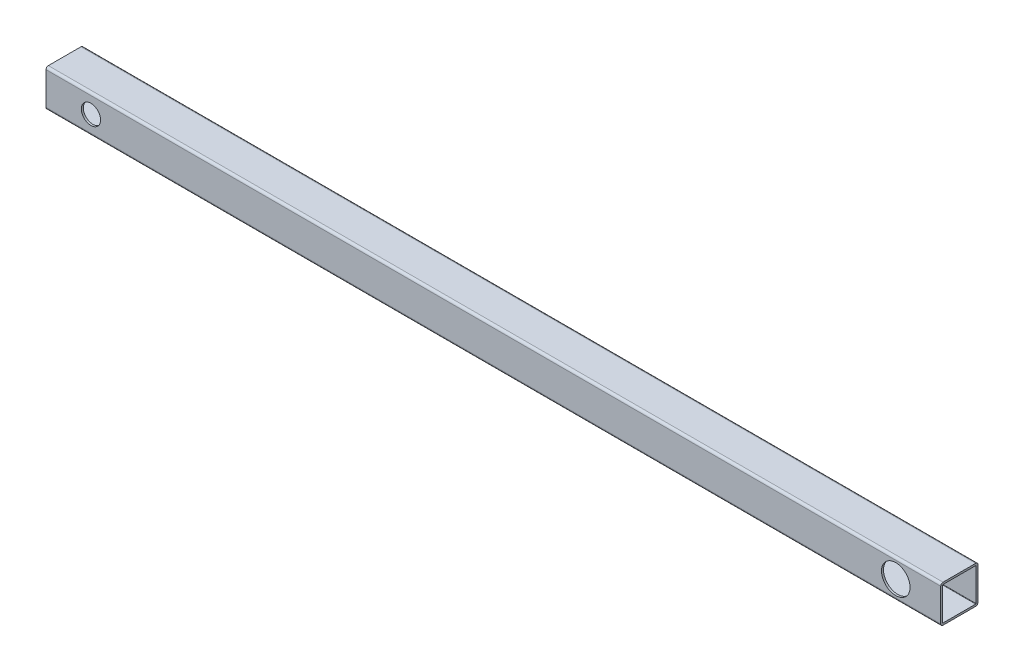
from build123d import *

# Parameters (mm, degrees)
EXTRUDE1_DEPTH          = 609.6
CUT_EXTRUDE1_DEPTH      = 611.407241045
CUT_EXTRUDE1_DEPTH_BACK = 611.407241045
SKETCH2_R               = 9.7234375
SKETCH2_R_2             = 6.5484375


with BuildPart() as part:
    # Sketch1 → Extrude1 (new body)
    with BuildSketch(Plane(origin=(0, 0, 0), x_dir=(0, 0, -1), z_dir=(1, 0, 0))):
        with BuildLine():
            Line((-5.373037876, 5.244240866), (16.851962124, 5.244240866))
            ThreePointArc((16.851962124, 5.244240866), (17.974494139, 4.779272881), (18.439462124, 3.656740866))
            Line((18.439462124, 3.656740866), (18.439462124, -18.568259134))
            ThreePointArc((18.439462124, -18.568259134), (17.974494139, -19.690791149), (16.851962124, -20.155759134))
            Line((16.851962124, -20.155759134), (-5.373037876, -20.155759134))
            ThreePointArc((-5.373037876, -20.155759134), (-6.495569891, -19.690791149), (-6.960537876, -18.568259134))
            Line((-6.960537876, -18.568259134), (-6.960537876, 3.656740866))
            ThreePointArc((-6.960537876, 3.656740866), (-6.495569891, 4.779272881), (-5.373037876, 5.244240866))
        make_face()
        with BuildLine():
            Line((-5.373037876, 3.898040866), (16.851962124, 3.898040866))
            ThreePointArc((16.851962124, 3.898040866), (17.02258699, 3.827365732), (17.093262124, 3.656740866))
            Line((17.093262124, 3.656740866), (17.093262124, -18.568259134))
            ThreePointArc((17.093262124, -18.568259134), (17.02258699, -18.738884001), (16.851962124, -18.809559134))
            Line((16.851962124, -18.809559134), (-5.373037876, -18.809559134))
            ThreePointArc((-5.373037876, -18.809559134), (-5.543662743, -18.738884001), (-5.614337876, -18.568259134))
            Line((-5.614337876, -18.568259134), (-5.614337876, 3.656740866))
            ThreePointArc((-5.614337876, 3.656740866), (-5.543662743, 3.827365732), (-5.373037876, 3.898040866))
        make_face(mode=Mode.SUBTRACT)
    extrude(amount=EXTRUDE1_DEPTH)

    # Sketch2 → Cut-Extrude1 (cut, two sides: drawn at the far end of the back side and taken through both)
    with BuildSketch(Plane(origin=(0, 0, 5.614337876), x_dir=(-1, 0, 0), z_dir=(0, 0, -1)).offset(-CUT_EXTRUDE1_DEPTH_BACK)):
        with Locations(Location((-578.973705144, -7.455759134, 0), (0, 0, 90))):
            Circle(SKETCH2_R)
        with Locations(Location((-30.626294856, -7.455759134, 0), (0, 0, 90))):
            Circle(SKETCH2_R_2)
    extrude(amount=CUT_EXTRUDE1_DEPTH + CUT_EXTRUDE1_DEPTH_BACK, mode=Mode.SUBTRACT)


solid = part.part
